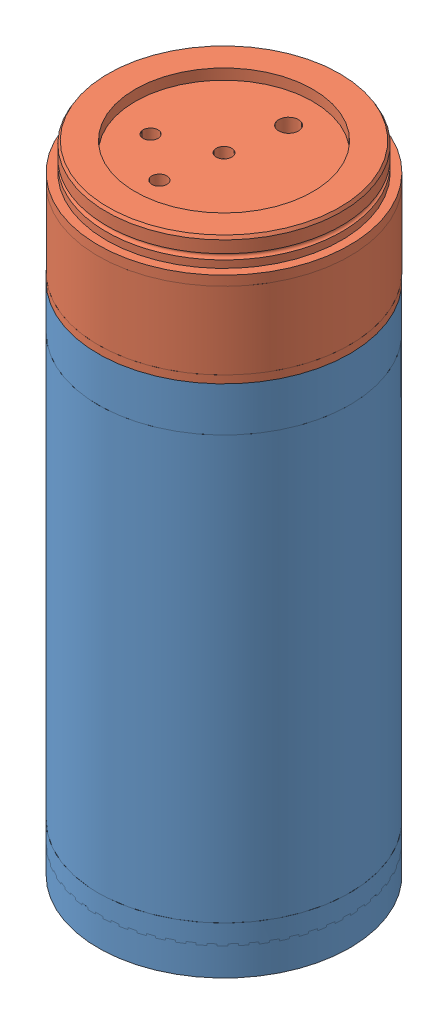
SolidWorks assembly MergedAssem.SLDASM, configuration Default (file format 10000). Lengths in mm.
Overall size (233.85 420.76 233.85).
2 component instances, 2 part files, 3 mates.
Components (placement in the parent):
- Delrin Compute HousingPart-1: Delrin Compute HousingPart.SLDPRT [Default] at (78.0334 -165.9541 -196.7221) size (166.37 340.2 166.37)
- ComputeNodeHousingPart-1: ComputeNodeHousingPart.SLDPRT [Default] at (96.5488 88.6028 61.3475) x (0.624739 0 -0.780834) z (0 1 0) size (166.37 166.37 109.85)
Mates (geometry in assembly coordinates):
- Concentric1: concentric: cylinder of Delrin Compute HousingPart-1 through (68.6026 137.5127 -33.9581) axis (0 -1 0) radius 83.185; cylinder of ComputeNodeHousingPart-1 through (68.6026 507.2661 -33.9581) axis (0 1 0) radius 83.185
- Coincident1: coincident: plane of Delrin Compute HousingPart-1 through (68.6026 166.7989 -33.9581) normal (0 1 0); plane of ComputeNodeHousingPart-1 through (209.1599 166.7989 -49.5677) normal (0 -1 0)
- Concentric2: concentric anti-aligned: cylinder of Delrin Compute HousingPart-1 through (62.9543 -162.0873 3.1141) axis (0 -1 0) radius 4.9606; cylinder of ComputeNodeHousingPart-1 through (62.9543 247.3623 3.1141) axis (0 1 0) radius 4.9606
